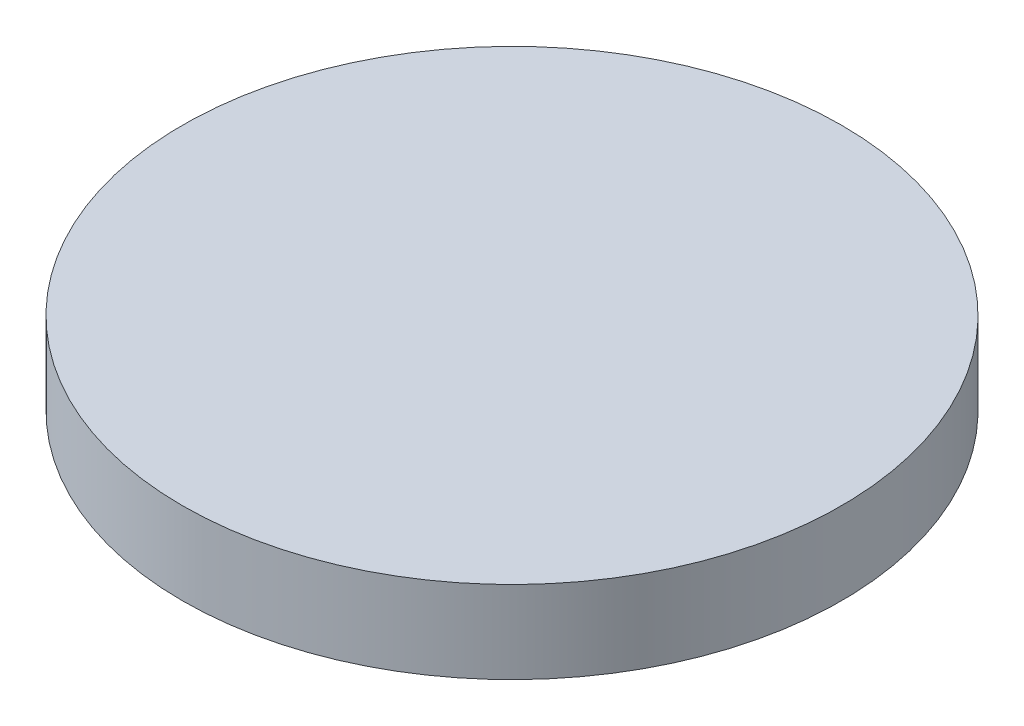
from build123d import *

# Parameters (mm, degrees)
SKETCH1_R           = 50.8
BOSS_EXTRUDE1_DEPTH = 12.7


with BuildPart() as part:
    # Sketch1 → Boss-Extrude1 (new body)
    with BuildSketch(Plane(origin=(0, 0, 0), x_dir=(1, 0, 0), z_dir=(0, 1, 0))):
        with Locations(Location((0, 0, 0), (0, 0, 270))):
            Circle(SKETCH1_R)
    extrude(amount=BOSS_EXTRUDE1_DEPTH)


solid = part.part
